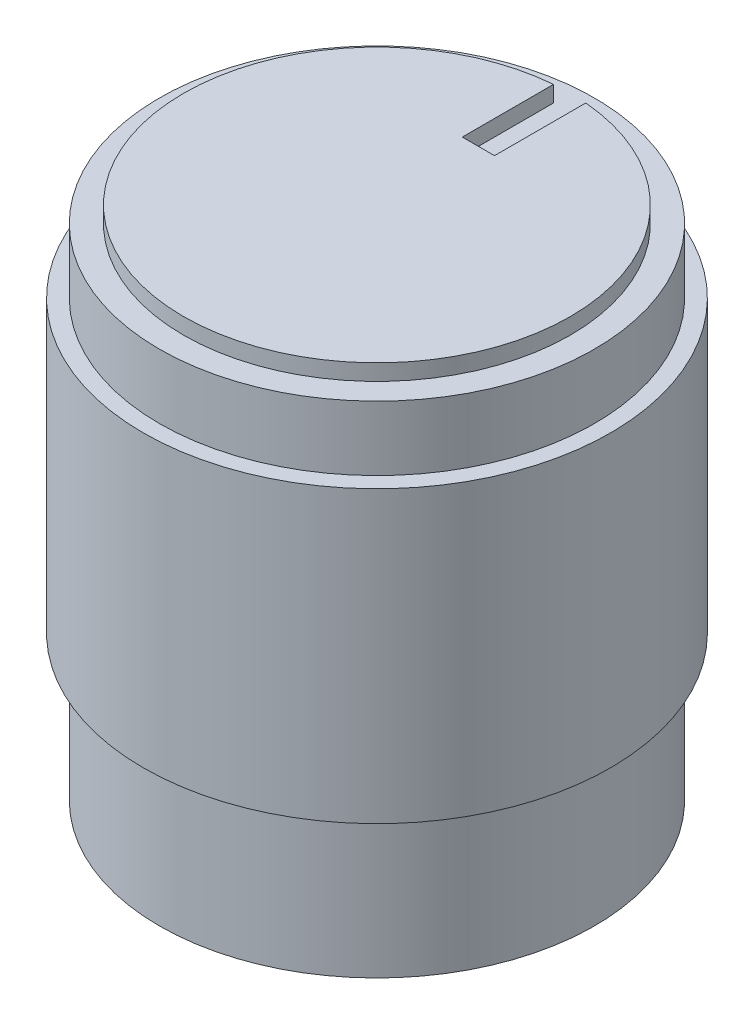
ISO-10303-21;
HEADER;
FILE_DESCRIPTION(('STEP AP214'),'2;1');
FILE_NAME('part.step','',(''),(''),'','','');
FILE_SCHEMA(('AUTOMOTIVE_DESIGN { 1 0 10303 214 1 1 1 1 }'));
ENDSEC;
DATA;
#1=APPLICATION_CONTEXT('core data for automotive mechanical design processes');
#2=APPLICATION_PROTOCOL_DEFINITION('international standard','automotive_design',2000,#1);
#3=PRODUCT_CONTEXT('',#1,'mechanical');
#4=PRODUCT('Part','Part','',(#3));
#5=PRODUCT_RELATED_PRODUCT_CATEGORY('part','',(#4));
#6=PRODUCT_DEFINITION_FORMATION('','',#4);
#7=PRODUCT_DEFINITION_CONTEXT('part definition',#1,'design');
#8=PRODUCT_DEFINITION('design','',#6,#7);
#9=PRODUCT_DEFINITION_SHAPE('','',#8);
#10=(LENGTH_UNIT() NAMED_UNIT(*) SI_UNIT(.MILLI.,.METRE.));
#11=(NAMED_UNIT(*) PLANE_ANGLE_UNIT() SI_UNIT($,.RADIAN.));
#12=(NAMED_UNIT(*) SI_UNIT($,.STERADIAN.) SOLID_ANGLE_UNIT());
#13=UNCERTAINTY_MEASURE_WITH_UNIT(LENGTH_MEASURE(1.E-05),#10,'distance_accuracy_value','');
#14=(GEOMETRIC_REPRESENTATION_CONTEXT(3) GLOBAL_UNCERTAINTY_ASSIGNED_CONTEXT((#13)) GLOBAL_UNIT_ASSIGNED_CONTEXT((#10,
#11,#12)) REPRESENTATION_CONTEXT('',''));
#15=CARTESIAN_POINT('',(0.,0.,0.));
#16=DIRECTION('',(0.,0.,1.));
#17=DIRECTION('',(1.,0.,0.));
#18=AXIS2_PLACEMENT_3D('',#15,#16,#17);
#19=CARTESIAN_POINT('',(0.,15.5,0.));
#20=DIRECTION('',(0.,1.,0.));
#21=DIRECTION('',(0.,0.,1.));
#22=AXIS2_PLACEMENT_3D('',#19,#20,#21);
#23=PLANE('',#22);
#24=CARTESIAN_POINT('',(0.,15.5,0.));
#25=DIRECTION('',(0.,1.,0.));
#26=DIRECTION('',(0.,0.,1.));
#27=AXIS2_PLACEMENT_3D('',#24,#25,#26);
#28=CIRCLE('',#27,6.);
#29=CARTESIAN_POINT('',(-0.5,15.5,-5.9791303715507));
#30=VERTEX_POINT('',#29);
#31=CARTESIAN_POINT('',(0.5,15.5,-5.9791303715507));
#32=VERTEX_POINT('',#31);
#33=EDGE_CURVE('E78',#30,#32,#28,.T.);
#34=ORIENTED_EDGE('',*,*,#33,.F.);
#35=DIRECTION('',(0.,0.,1.));
#36=VECTOR('',#35,1.);
#37=CARTESIAN_POINT('',(-0.5,15.5,-3.14796876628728));
#38=LINE('',#37,#36);
#39=CARTESIAN_POINT('',(-0.5,15.5,-3.14796876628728));
#40=VERTEX_POINT('',#39);
#41=EDGE_CURVE('E54',#30,#40,#38,.T.);
#42=ORIENTED_EDGE('',*,*,#41,.T.);
#43=DIRECTION('',(1.,0.,0.));
#44=VECTOR('',#43,1.);
#45=CARTESIAN_POINT('',(-0.5,15.5,-3.14796876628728));
#46=LINE('',#45,#44);
#47=CARTESIAN_POINT('',(0.5,15.5,-3.14796876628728));
#48=VERTEX_POINT('',#47);
#49=EDGE_CURVE('E76',#40,#48,#46,.T.);
#50=ORIENTED_EDGE('',*,*,#49,.T.);
#51=DIRECTION('',(0.,0.,-1.));
#52=VECTOR('',#51,1.);
#53=CARTESIAN_POINT('',(0.5,15.5,-3.14796876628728));
#54=LINE('',#53,#52);
#55=EDGE_CURVE('E85',#48,#32,#54,.T.);
#56=ORIENTED_EDGE('',*,*,#55,.T.);
#57=EDGE_LOOP('',(#34,#42,#50,#56));
#58=FACE_BOUND('',#57,.T.);
#59=CARTESIAN_POINT('',(0.,15.5,0.));
#60=DIRECTION('',(0.,1.,0.));
#61=DIRECTION('',(0.,0.,1.));
#62=AXIS2_PLACEMENT_3D('',#59,#60,#61);
#63=CIRCLE('',#62,6.75);
#64=CARTESIAN_POINT('',(0.,15.5,6.75));
#65=VERTEX_POINT('',#64);
#66=EDGE_CURVE('E108',#65,#65,#63,.T.);
#67=ORIENTED_EDGE('',*,*,#66,.T.);
#68=EDGE_LOOP('',(#67));
#69=FACE_BOUND('',#68,.T.);
#70=ADVANCED_FACE('F33',(#58,#69),#23,.T.);
#71=CARTESIAN_POINT('',(0.,13.5,0.));
#72=DIRECTION('',(0.,1.,0.));
#73=DIRECTION('',(0.,0.,1.));
#74=AXIS2_PLACEMENT_3D('',#71,#72,#73);
#75=PLANE('',#74);
#76=CARTESIAN_POINT('',(0.,13.5,0.));
#77=DIRECTION('',(0.,1.,0.));
#78=DIRECTION('',(0.,0.,1.));
#79=AXIS2_PLACEMENT_3D('',#76,#77,#78);
#80=CIRCLE('',#79,7.25);
#81=CARTESIAN_POINT('',(0.,13.5,7.25));
#82=VERTEX_POINT('',#81);
#83=EDGE_CURVE('E114',#82,#82,#80,.T.);
#84=ORIENTED_EDGE('',*,*,#83,.T.);
#85=EDGE_LOOP('',(#84));
#86=FACE_BOUND('',#85,.T.);
#87=CARTESIAN_POINT('',(0.,13.5,0.));
#88=DIRECTION('',(0.,1.,0.));
#89=DIRECTION('',(0.,0.,1.));
#90=AXIS2_PLACEMENT_3D('',#87,#88,#89);
#91=CIRCLE('',#90,6.75);
#92=CARTESIAN_POINT('',(0.,13.5,6.75));
#93=VERTEX_POINT('',#92);
#94=EDGE_CURVE('E106',#93,#93,#91,.T.);
#95=ORIENTED_EDGE('',*,*,#94,.F.);
#96=EDGE_LOOP('',(#95));
#97=FACE_BOUND('',#96,.T.);
#98=ADVANCED_FACE('F138',(#86,#97),#75,.T.);
#99=CARTESIAN_POINT('',(0.,4.5,0.));
#100=DIRECTION('',(0.,-1.,0.));
#101=DIRECTION('',(0.,0.,-1.));
#102=AXIS2_PLACEMENT_3D('',#99,#100,#101);
#103=CYLINDRICAL_SURFACE('',#102,6.75);
#104=CARTESIAN_POINT('',(0.,4.5,0.));
#105=DIRECTION('',(0.,1.,0.));
#106=DIRECTION('',(0.,0.,1.));
#107=AXIS2_PLACEMENT_3D('',#104,#105,#106);
#108=CIRCLE('',#107,6.75);
#109=CARTESIAN_POINT('',(0.,4.5,6.75));
#110=VERTEX_POINT('',#109);
#111=EDGE_CURVE('E41',#110,#110,#108,.T.);
#112=ORIENTED_EDGE('',*,*,#111,.F.);
#113=EDGE_LOOP('',(#112));
#114=FACE_BOUND('',#113,.T.);
#115=CARTESIAN_POINT('',(0.,0.,0.));
#116=DIRECTION('',(0.,1.,0.));
#117=DIRECTION('',(0.,0.,1.));
#118=AXIS2_PLACEMENT_3D('',#115,#116,#117);
#119=CIRCLE('',#118,6.75);
#120=CARTESIAN_POINT('',(0.,0.,6.75));
#121=VERTEX_POINT('',#120);
#122=EDGE_CURVE('E117',#121,#121,#119,.T.);
#123=ORIENTED_EDGE('',*,*,#122,.T.);
#124=EDGE_LOOP('',(#123));
#125=FACE_BOUND('',#124,.T.);
#126=ADVANCED_FACE('F35',(#114,#125),#103,.T.);
#127=CARTESIAN_POINT('',(0.,0.,0.));
#128=DIRECTION('',(0.,1.,0.));
#129=DIRECTION('',(0.,0.,1.));
#130=AXIS2_PLACEMENT_3D('',#127,#128,#129);
#131=PLANE('',#130);
#132=CARTESIAN_POINT('',(0.,0.,0.));
#133=DIRECTION('',(0.,-1.,0.));
#134=DIRECTION('',(0.,0.,-1.));
#135=AXIS2_PLACEMENT_3D('',#132,#133,#134);
#136=CIRCLE('',#135,6.25);
#137=CARTESIAN_POINT('',(0.,0.,-6.25));
#138=VERTEX_POINT('',#137);
#139=EDGE_CURVE('E293',#138,#138,#136,.T.);
#140=ORIENTED_EDGE('',*,*,#139,.F.);
#141=EDGE_LOOP('',(#140));
#142=FACE_BOUND('',#141,.T.);
#143=ORIENTED_EDGE('',*,*,#122,.F.);
#144=EDGE_LOOP('',(#143));
#145=FACE_BOUND('',#144,.T.);
#146=ADVANCED_FACE('F125',(#142,#145),#131,.F.);
#147=CARTESIAN_POINT('',(0.,4.5,0.));
#148=DIRECTION('',(0.,1.,0.));
#149=DIRECTION('',(0.,0.,1.));
#150=AXIS2_PLACEMENT_3D('',#147,#148,#149);
#151=PLANE('',#150);
#152=CARTESIAN_POINT('',(0.,4.5,0.));
#153=DIRECTION('',(0.,1.,0.));
#154=DIRECTION('',(0.,0.,1.));
#155=AXIS2_PLACEMENT_3D('',#152,#153,#154);
#156=CIRCLE('',#155,7.25);
#157=CARTESIAN_POINT('',(0.,4.5,7.25));
#158=VERTEX_POINT('',#157);
#159=EDGE_CURVE('E111',#158,#158,#156,.T.);
#160=ORIENTED_EDGE('',*,*,#159,.F.);
#161=EDGE_LOOP('',(#160));
#162=FACE_BOUND('',#161,.T.);
#163=ORIENTED_EDGE('',*,*,#111,.T.);
#164=EDGE_LOOP('',(#163));
#165=FACE_BOUND('',#164,.T.);
#166=ADVANCED_FACE('F127',(#162,#165),#151,.F.);
#167=CARTESIAN_POINT('',(0.,13.5,0.));
#168=DIRECTION('',(0.,-1.,0.));
#169=DIRECTION('',(0.,0.,-1.));
#170=AXIS2_PLACEMENT_3D('',#167,#168,#169);
#171=CYLINDRICAL_SURFACE('',#170,7.25);
#172=ORIENTED_EDGE('',*,*,#83,.F.);
#173=EDGE_LOOP('',(#172));
#174=FACE_BOUND('',#173,.T.);
#175=ORIENTED_EDGE('',*,*,#159,.T.);
#176=EDGE_LOOP('',(#175));
#177=FACE_BOUND('',#176,.T.);
#178=ADVANCED_FACE('F134',(#174,#177),#171,.T.);
#179=CARTESIAN_POINT('',(0.,15.5,0.));
#180=DIRECTION('',(0.,-1.,0.));
#181=DIRECTION('',(0.,0.,-1.));
#182=AXIS2_PLACEMENT_3D('',#179,#180,#181);
#183=CYLINDRICAL_SURFACE('',#182,6.75);
#184=ORIENTED_EDGE('',*,*,#66,.F.);
#185=EDGE_LOOP('',(#184));
#186=FACE_BOUND('',#185,.T.);
#187=ORIENTED_EDGE('',*,*,#94,.T.);
#188=EDGE_LOOP('',(#187));
#189=FACE_BOUND('',#188,.T.);
#190=ADVANCED_FACE('F153',(#186,#189),#183,.T.);
#191=CARTESIAN_POINT('',(0.,16.,0.));
#192=DIRECTION('',(0.,-1.,0.));
#193=DIRECTION('',(0.,0.,-1.));
#194=AXIS2_PLACEMENT_3D('',#191,#192,#193);
#195=CYLINDRICAL_SURFACE('',#194,6.);
#196=CARTESIAN_POINT('',(0.,16.,0.));
#197=DIRECTION('',(0.,1.,0.));
#198=DIRECTION('',(0.,0.,1.));
#199=AXIS2_PLACEMENT_3D('',#196,#197,#198);
#200=CIRCLE('',#199,6.);
#201=CARTESIAN_POINT('',(-0.5,16.,-5.9791303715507));
#202=VERTEX_POINT('',#201);
#203=CARTESIAN_POINT('',(0.5,16.,-5.9791303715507));
#204=VERTEX_POINT('',#203);
#205=EDGE_CURVE('E103',#202,#204,#200,.T.);
#206=ORIENTED_EDGE('',*,*,#205,.F.);
#207=DIRECTION('',(0.,-1.,0.));
#208=VECTOR('',#207,1.);
#209=CARTESIAN_POINT('',(-0.5,16.,-5.9791303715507));
#210=LINE('',#209,#208);
#211=EDGE_CURVE('E101',#202,#30,#210,.T.);
#212=ORIENTED_EDGE('',*,*,#211,.T.);
#213=ORIENTED_EDGE('',*,*,#33,.T.);
#214=DIRECTION('',(0.,-1.,0.));
#215=VECTOR('',#214,1.);
#216=CARTESIAN_POINT('',(0.5,16.,-5.9791303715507));
#217=LINE('',#216,#215);
#218=EDGE_CURVE('E97',#32,#204,#217,.F.);
#219=ORIENTED_EDGE('',*,*,#218,.T.);
#220=EDGE_LOOP('',(#206,#212,#213,#219));
#221=FACE_BOUND('',#220,.T.);
#222=ADVANCED_FACE('F151',(#221),#195,.T.);
#223=CARTESIAN_POINT('',(0.,16.,0.));
#224=DIRECTION('',(0.,1.,0.));
#225=DIRECTION('',(0.,0.,1.));
#226=AXIS2_PLACEMENT_3D('',#223,#224,#225);
#227=PLANE('',#226);
#228=DIRECTION('',(0.,0.,1.));
#229=VECTOR('',#228,1.);
#230=CARTESIAN_POINT('',(-0.5,16.,0.));
#231=LINE('',#230,#229);
#232=CARTESIAN_POINT('',(-0.5,16.,-3.14796876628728));
#233=VERTEX_POINT('',#232);
#234=EDGE_CURVE('E11',#202,#233,#231,.T.);
#235=ORIENTED_EDGE('',*,*,#234,.F.);
#236=ORIENTED_EDGE('',*,*,#205,.T.);
#237=DIRECTION('',(0.,0.,-1.));
#238=VECTOR('',#237,1.);
#239=CARTESIAN_POINT('',(0.5,16.,-3.14796876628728));
#240=LINE('',#239,#238);
#241=CARTESIAN_POINT('',(0.5,16.,-3.14796876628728));
#242=VERTEX_POINT('',#241);
#243=EDGE_CURVE('E79',#242,#204,#240,.T.);
#244=ORIENTED_EDGE('',*,*,#243,.F.);
#245=DIRECTION('',(1.,0.,0.));
#246=VECTOR('',#245,1.);
#247=CARTESIAN_POINT('',(-0.5,16.,-3.14796876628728));
#248=LINE('',#247,#246);
#249=EDGE_CURVE('E93',#233,#242,#248,.T.);
#250=ORIENTED_EDGE('',*,*,#249,.F.);
#251=EDGE_LOOP('',(#235,#236,#244,#250));
#252=FACE_BOUND('',#251,.T.);
#253=ADVANCED_FACE('F182',(#252),#227,.T.);
#254=CARTESIAN_POINT('',(-0.5,15.5,-3.14796876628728));
#255=DIRECTION('',(-1.,0.,0.));
#256=DIRECTION('',(0.,0.,1.));
#257=AXIS2_PLACEMENT_3D('',#254,#255,#256);
#258=PLANE('',#257);
#259=ORIENTED_EDGE('',*,*,#234,.T.);
#260=DIRECTION('',(0.,1.,0.));
#261=VECTOR('',#260,1.);
#262=CARTESIAN_POINT('',(-0.5,15.5,-3.14796876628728));
#263=LINE('',#262,#261);
#264=EDGE_CURVE('E48',#40,#233,#263,.T.);
#265=ORIENTED_EDGE('',*,*,#264,.F.);
#266=ORIENTED_EDGE('',*,*,#41,.F.);
#267=ORIENTED_EDGE('',*,*,#211,.F.);
#268=EDGE_LOOP('',(#259,#265,#266,#267));
#269=FACE_BOUND('',#268,.T.);
#270=ADVANCED_FACE('F81',(#269),#258,.F.);
#271=CARTESIAN_POINT('',(0.5,15.5,-3.14796876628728));
#272=DIRECTION('',(1.,0.,0.));
#273=DIRECTION('',(0.,0.,-1.));
#274=AXIS2_PLACEMENT_3D('',#271,#272,#273);
#275=PLANE('',#274);
#276=ORIENTED_EDGE('',*,*,#55,.F.);
#277=DIRECTION('',(0.,1.,0.));
#278=VECTOR('',#277,1.);
#279=CARTESIAN_POINT('',(0.5,15.5,-3.14796876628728));
#280=LINE('',#279,#278);
#281=EDGE_CURVE('E84',#48,#242,#280,.T.);
#282=ORIENTED_EDGE('',*,*,#281,.T.);
#283=ORIENTED_EDGE('',*,*,#243,.T.);
#284=ORIENTED_EDGE('',*,*,#218,.F.);
#285=EDGE_LOOP('',(#276,#282,#283,#284));
#286=FACE_BOUND('',#285,.T.);
#287=ADVANCED_FACE('F195',(#286),#275,.F.);
#288=CARTESIAN_POINT('',(-0.5,15.5,-3.14796876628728));
#289=DIRECTION('',(0.,0.,1.));
#290=DIRECTION('',(1.,0.,0.));
#291=AXIS2_PLACEMENT_3D('',#288,#289,#290);
#292=PLANE('',#291);
#293=ORIENTED_EDGE('',*,*,#249,.T.);
#294=ORIENTED_EDGE('',*,*,#281,.F.);
#295=ORIENTED_EDGE('',*,*,#49,.F.);
#296=ORIENTED_EDGE('',*,*,#264,.T.);
#297=EDGE_LOOP('',(#293,#294,#295,#296));
#298=FACE_BOUND('',#297,.T.);
#299=ADVANCED_FACE('F87',(#298),#292,.F.);
#300=CARTESIAN_POINT('',(0.,5.,0.));
#301=DIRECTION('',(0.,-1.,0.));
#302=DIRECTION('',(0.,0.,-1.));
#303=AXIS2_PLACEMENT_3D('',#300,#301,#302);
#304=CYLINDRICAL_SURFACE('',#303,6.25);
#305=CARTESIAN_POINT('',(0.,5.,0.));
#306=DIRECTION('',(0.,-1.,0.));
#307=DIRECTION('',(0.,0.,-1.));
#308=AXIS2_PLACEMENT_3D('',#305,#306,#307);
#309=CIRCLE('',#308,6.25);
#310=CARTESIAN_POINT('',(0.,5.,-6.25));
#311=VERTEX_POINT('',#310);
#312=EDGE_CURVE('E95',#311,#311,#309,.T.);
#313=ORIENTED_EDGE('',*,*,#312,.F.);
#314=EDGE_LOOP('',(#313));
#315=FACE_BOUND('',#314,.T.);
#316=ORIENTED_EDGE('',*,*,#139,.T.);
#317=EDGE_LOOP('',(#316));
#318=FACE_BOUND('',#317,.T.);
#319=ADVANCED_FACE('F208',(#315,#318),#304,.F.);
#320=CARTESIAN_POINT('',(0.,5.,0.));
#321=DIRECTION('',(0.,-1.,0.));
#322=DIRECTION('',(0.,0.,-1.));
#323=AXIS2_PLACEMENT_3D('',#320,#321,#322);
#324=PLANE('',#323);
#325=CARTESIAN_POINT('',(0.,5.,0.));
#326=DIRECTION('',(0.,-1.,0.));
#327=DIRECTION('',(0.,0.,-1.));
#328=AXIS2_PLACEMENT_3D('',#325,#326,#327);
#329=CIRCLE('',#328,3.);
#330=CARTESIAN_POINT('',(0.,5.,-3.));
#331=VERTEX_POINT('',#330);
#332=EDGE_CURVE('E294',#331,#331,#329,.T.);
#333=ORIENTED_EDGE('',*,*,#332,.F.);
#334=EDGE_LOOP('',(#333));
#335=FACE_BOUND('',#334,.T.);
#336=ORIENTED_EDGE('',*,*,#312,.T.);
#337=EDGE_LOOP('',(#336));
#338=FACE_BOUND('',#337,.T.);
#339=ADVANCED_FACE('F214',(#335,#338),#324,.T.);
#340=CARTESIAN_POINT('',(0.,15.,0.));
#341=DIRECTION('',(0.,-1.,0.));
#342=DIRECTION('',(0.,0.,-1.));
#343=AXIS2_PLACEMENT_3D('',#340,#341,#342);
#344=CYLINDRICAL_SURFACE('',#343,3.);
#345=CARTESIAN_POINT('',(0.,15.,0.));
#346=DIRECTION('',(0.,-1.,0.));
#347=DIRECTION('',(0.,0.,-1.));
#348=AXIS2_PLACEMENT_3D('',#345,#346,#347);
#349=CIRCLE('',#348,3.);
#350=CARTESIAN_POINT('',(0.,15.,-3.));
#351=VERTEX_POINT('',#350);
#352=EDGE_CURVE('E292',#351,#351,#349,.T.);
#353=ORIENTED_EDGE('',*,*,#352,.F.);
#354=EDGE_LOOP('',(#353));
#355=FACE_BOUND('',#354,.T.);
#356=ORIENTED_EDGE('',*,*,#332,.T.);
#357=EDGE_LOOP('',(#356));
#358=FACE_BOUND('',#357,.T.);
#359=ADVANCED_FACE('F222',(#355,#358),#344,.F.);
#360=CARTESIAN_POINT('',(0.,15.,0.));
#361=DIRECTION('',(0.,-1.,0.));
#362=DIRECTION('',(0.,0.,-1.));
#363=AXIS2_PLACEMENT_3D('',#360,#361,#362);
#364=PLANE('',#363);
#365=ORIENTED_EDGE('',*,*,#352,.T.);
#366=EDGE_LOOP('',(#365));
#367=FACE_BOUND('',#366,.T.);
#368=ADVANCED_FACE('F230',(#367),#364,.T.);
#369=CLOSED_SHELL('',(#70,#98,#126,#146,#166,#178,#190,#222,#253,#270,#287,#299,#319,#339,#359,#368));
#370=MANIFOLD_SOLID_BREP('B2',#369);
#371=ADVANCED_BREP_SHAPE_REPRESENTATION('',(#18,#370),#14);
#372=SHAPE_DEFINITION_REPRESENTATION(#9,#371);
ENDSEC;
END-ISO-10303-21;
